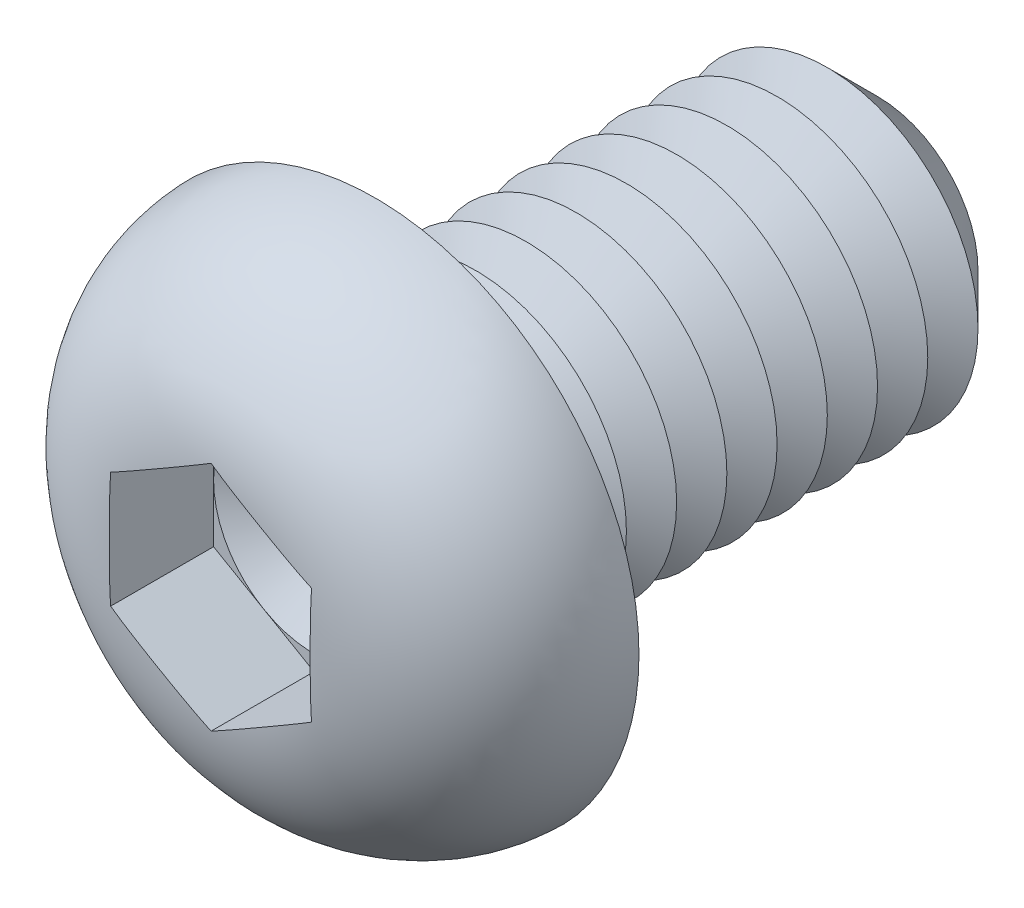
from build123d import *

# Parameters (mm, degrees)
CUT_EXTRUDE1_DEPTH  = 2.08
SKETCH4_R           = 3
BOSS_EXTRUDE1_DEPTH = 10
CHAMFER1_SIZE       = 1
LPATTERN1_COUNT     = 8
LPATTERN1_PITCH     = 1
FILLET2_R           = 0.5


with BuildPart() as part:
    # Sketch2 → Revolve1 (revolve)
    with BuildSketch(Plane(origin=(0, 0, 0), x_dir=(0, 0, -1), z_dir=(1, 0, 0)), mode=Mode.PRIVATE) as revolve1_sk:
        with BuildLine():
            Line((0, 0), (-3.3, 0))
            Line((-3.3, 0), (-3.3, 1.851470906))
            ThreePointArc((-3.3, 1.851470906), (-2.339262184, 4.220014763), (0, 5.25))
            Line((0, 5.25), (0, 0))
        make_face()
    revolve(revolve1_sk.sketch.rotate(Axis((0, 0, 47.934239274), (0, 0, -1)), 90), axis=Axis((0, 0, 47.934239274), (0, 0, -1)))

    # Sketch3 → Cut-Extrude1 (cut)
    with BuildSketch(Plane.XY.offset(3.3)):
        Polygon((0, 2.309401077), (-2, 1.154700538), (-2, -1.154700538), (0, -2.309401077), (2, -1.154700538), (2, 1.154700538), align=None)
    extrude(amount=-CUT_EXTRUDE1_DEPTH, mode=Mode.SUBTRACT)

    # Sketch4 → Boss-Extrude1 (add)
    with BuildSketch(Plane(origin=(0, 0, 0), x_dir=(-1, 0, 0), z_dir=(0, 0, -1))):
        Circle(SKETCH4_R)
    extrude(amount=BOSS_EXTRUDE1_DEPTH)

    # Chamfer1
    chamfer1_edges = [part.edges().sort_by_distance(p)[0] for p in [
        (3, 0, -10),
    ]]
    chamfer(chamfer1_edges, length=CHAMFER1_SIZE)

    # Sketch5 → Cut-Revolve1 (revolve, cut)
    with BuildSketch(Plane(origin=(0, 0, 0), x_dir=(0, 0, -1), z_dir=(1, 0, 0)), mode=Mode.PRIVATE) as cut_revolve1_sk:
        Polygon((1, 3), (2, 3), (1.5, 2.133974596), align=None)
    cut_revolve1 = revolve(cut_revolve1_sk.sketch.rotate(Axis((0, 0, 47.934239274), (0, 0, -1)), 90), axis=Axis((0, 0, 47.934239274), (0, 0, -1)), mode=Mode.SUBTRACT)

    # LPattern1: Cut-Revolve1 ×8
    with Locations(*[(0, 0, -i * LPATTERN1_PITCH) for i in range(1, LPATTERN1_COUNT)]):
        add(cut_revolve1, mode=Mode.SUBTRACT)

    # Fillet2
    fillet2_edges = [part.edges().sort_by_distance(p)[0] for p in [
        (3, 0, 0),
    ]]
    fillet(fillet2_edges, radius=FILLET2_R)

    # Cut-Extrude2 cone 1 section (on through the dimple's axis) → Cut-Extrude2 (revolve, cut)
    with BuildSketch(Plane(origin=(0, 0, 1.22), x_dir=(0, -1, 0), z_dir=(1, 0, 0))):
        Polygon((0, 0), (2, 0), (0, 1.154700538), align=None)
    revolve(axis=Axis((0, 0, 1.22), (0, 0, -1)), mode=Mode.SUBTRACT)


solid = part.part
